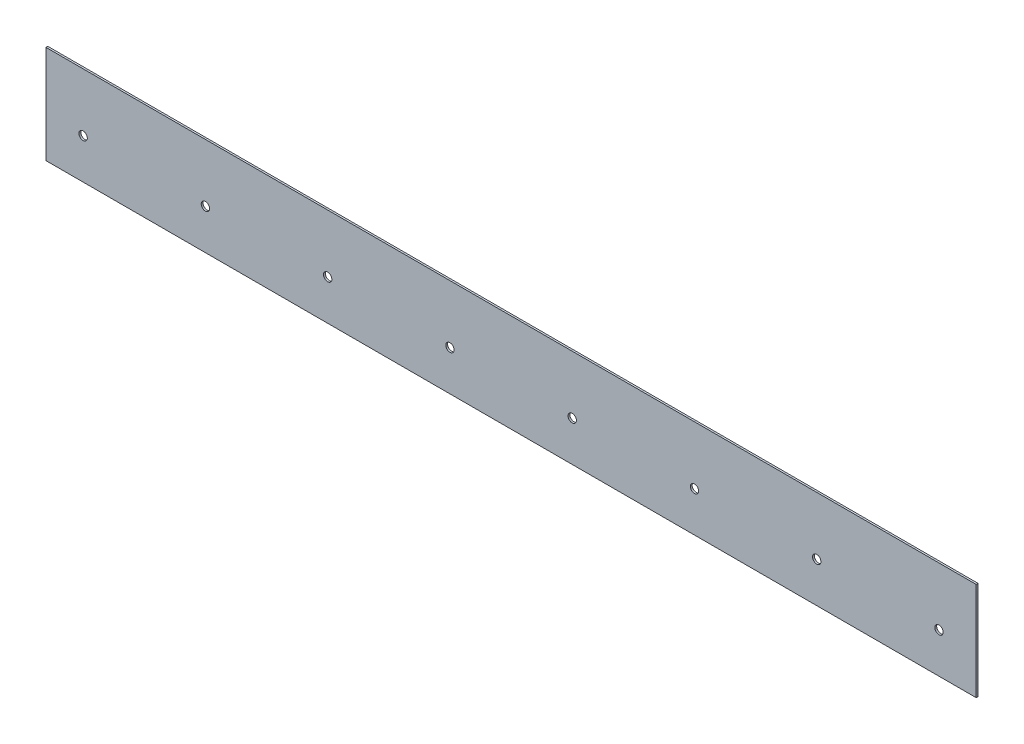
from build123d import *

# Parameters (mm, degrees)
SKETCH1_W                  = 5010.633524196
SKETCH1_H                  = 528.535100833
EXTRUDE1_DEPTH             = 10
F_45_0_45_DIAMETER_HOLE1_D = 45
LPATTERN1_COUNT            = 8
LPATTERN1_PITCH            = 658.661932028


with BuildPart() as part:
    # Sketch1 → Extrude1 (new body)
    with BuildSketch(Plane.XY):
        with Locations((2505.316762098, 264.267550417)):
            Rectangle(SKETCH1_W, SKETCH1_H)
    extrude(amount=EXTRUDE1_DEPTH)

    # 45.0 _45_ Diameter Hole1 (through all)
    with Locations(Plane.XY.offset(10)):
        with Locations((200, 216.299758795)):
            f_45_0_45_diameter_hole1 = Hole(F_45_0_45_DIAMETER_HOLE1_D / 2)

    # LPattern1: 45.0 _45_ Diameter Hole1 ×8
    with Locations(*[(i * LPATTERN1_PITCH, 0, 0) for i in range(1, LPATTERN1_COUNT)]):
        add(f_45_0_45_diameter_hole1, mode=Mode.SUBTRACT)


solid = part.part
